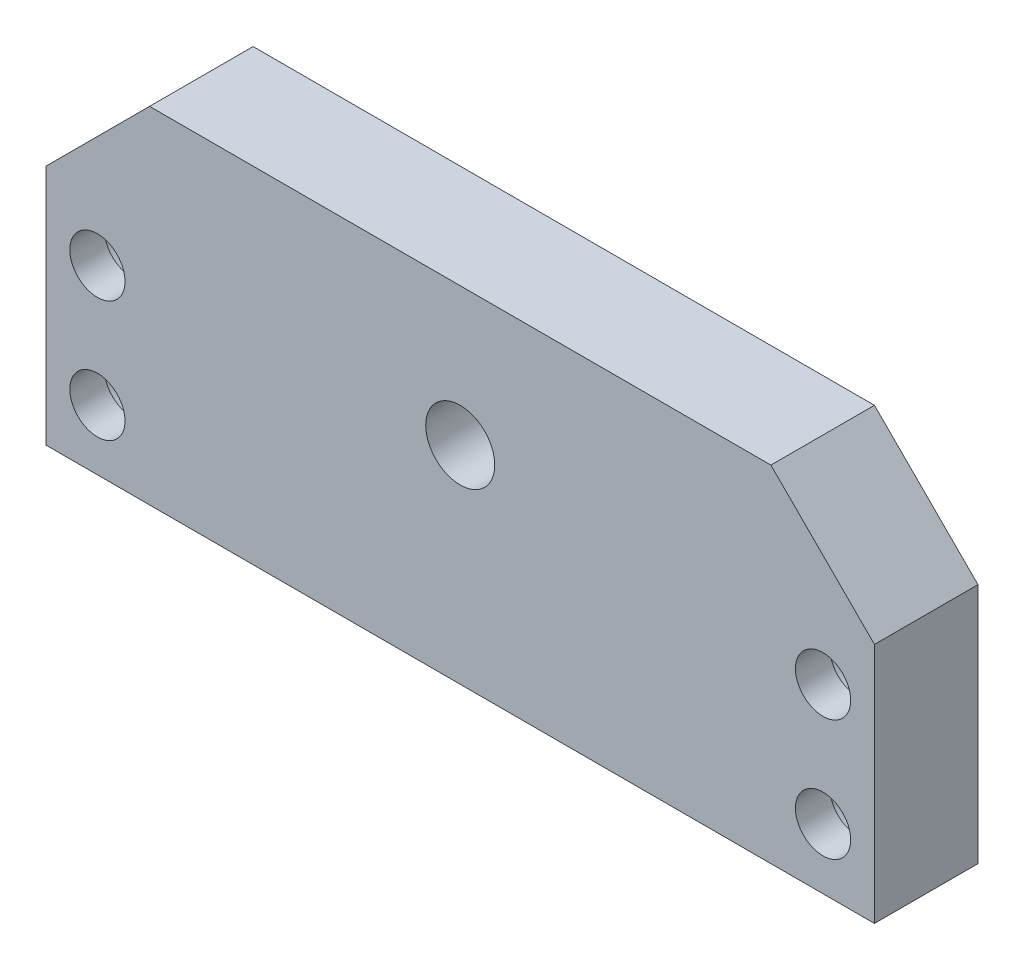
ISO-10303-21;
HEADER;
FILE_DESCRIPTION(('STEP AP214'),'2;1');
FILE_NAME('part.step','',(''),(''),'','','');
FILE_SCHEMA(('AUTOMOTIVE_DESIGN { 1 0 10303 214 1 1 1 1 }'));
ENDSEC;
DATA;
#1=APPLICATION_CONTEXT('core data for automotive mechanical design processes');
#2=APPLICATION_PROTOCOL_DEFINITION('international standard','automotive_design',2000,#1);
#3=PRODUCT_CONTEXT('',#1,'mechanical');
#4=PRODUCT('Part','Part','',(#3));
#5=PRODUCT_RELATED_PRODUCT_CATEGORY('part','',(#4));
#6=PRODUCT_DEFINITION_FORMATION('','',#4);
#7=PRODUCT_DEFINITION_CONTEXT('part definition',#1,'design');
#8=PRODUCT_DEFINITION('design','',#6,#7);
#9=PRODUCT_DEFINITION_SHAPE('','',#8);
#10=(LENGTH_UNIT() NAMED_UNIT(*) SI_UNIT(.MILLI.,.METRE.));
#11=(NAMED_UNIT(*) PLANE_ANGLE_UNIT() SI_UNIT($,.RADIAN.));
#12=(NAMED_UNIT(*) SI_UNIT($,.STERADIAN.) SOLID_ANGLE_UNIT());
#13=UNCERTAINTY_MEASURE_WITH_UNIT(LENGTH_MEASURE(1.E-05),#10,'distance_accuracy_value','');
#14=(GEOMETRIC_REPRESENTATION_CONTEXT(3) GLOBAL_UNCERTAINTY_ASSIGNED_CONTEXT((#13)) GLOBAL_UNIT_ASSIGNED_CONTEXT((#10,
#11,#12)) REPRESENTATION_CONTEXT('',''));
#15=CARTESIAN_POINT('',(0.,0.,0.));
#16=DIRECTION('',(0.,0.,1.));
#17=DIRECTION('',(1.,0.,0.));
#18=AXIS2_PLACEMENT_3D('',#15,#16,#17);
#19=CARTESIAN_POINT('',(0.,0.,0.));
#20=DIRECTION('',(0.,0.,-1.));
#21=DIRECTION('',(-1.,0.,0.));
#22=AXIS2_PLACEMENT_3D('',#19,#20,#21);
#23=PLANE('',#22);
#24=CARTESIAN_POINT('',(0.,4.99999999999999,0.));
#25=DIRECTION('',(0.,0.,-1.));
#26=DIRECTION('',(-1.,0.,0.));
#27=AXIS2_PLACEMENT_3D('',#24,#25,#26);
#28=CIRCLE('',#27,5.);
#29=CARTESIAN_POINT('',(-5.,4.99999999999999,0.));
#30=VERTEX_POINT('',#29);
#31=EDGE_CURVE('E194',#30,#30,#28,.T.);
#32=ORIENTED_EDGE('',*,*,#31,.F.);
#33=EDGE_LOOP('',(#32));
#34=FACE_BOUND('',#33,.T.);
#35=CARTESIAN_POINT('',(-52.5535278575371,1.25000000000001,0.));
#36=DIRECTION('',(0.,0.,-1.));
#37=DIRECTION('',(-1.,0.,0.));
#38=AXIS2_PLACEMENT_3D('',#35,#36,#37);
#39=CIRCLE('',#38,6.25);
#40=CARTESIAN_POINT('',(-58.8035278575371,1.25000000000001,0.));
#41=VERTEX_POINT('',#40);
#42=EDGE_CURVE('E160',#41,#41,#39,.F.);
#43=ORIENTED_EDGE('',*,*,#42,.T.);
#44=EDGE_LOOP('',(#43));
#45=FACE_BOUND('',#44,.T.);
#46=CARTESIAN_POINT('',(-52.5535278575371,-16.25,0.));
#47=DIRECTION('',(0.,0.,-1.));
#48=DIRECTION('',(-1.,0.,0.));
#49=AXIS2_PLACEMENT_3D('',#46,#47,#48);
#50=CIRCLE('',#49,6.25);
#51=CARTESIAN_POINT('',(-58.8035278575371,-16.25,0.));
#52=VERTEX_POINT('',#51);
#53=EDGE_CURVE('E153',#52,#52,#50,.F.);
#54=ORIENTED_EDGE('',*,*,#53,.T.);
#55=EDGE_LOOP('',(#54));
#56=FACE_BOUND('',#55,.T.);
#57=CARTESIAN_POINT('',(52.5535278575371,1.25,0.));
#58=DIRECTION('',(0.,0.,-1.));
#59=DIRECTION('',(-1.,0.,0.));
#60=AXIS2_PLACEMENT_3D('',#57,#58,#59);
#61=CIRCLE('',#60,6.25);
#62=CARTESIAN_POINT('',(46.3035278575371,1.25,0.));
#63=VERTEX_POINT('',#62);
#64=EDGE_CURVE('E147',#63,#63,#61,.T.);
#65=ORIENTED_EDGE('',*,*,#64,.F.);
#66=EDGE_LOOP('',(#65));
#67=FACE_BOUND('',#66,.T.);
#68=DIRECTION('',(0.,-1.,0.));
#69=VECTOR('',#68,1.);
#70=CARTESIAN_POINT('',(-60.,-25.,0.));
#71=LINE('',#70,#69);
#72=CARTESIAN_POINT('',(-60.,10.,0.));
#73=VERTEX_POINT('',#72);
#74=CARTESIAN_POINT('',(-60.,-25.,0.));
#75=VERTEX_POINT('',#74);
#76=EDGE_CURVE('E104',#73,#75,#71,.T.);
#77=ORIENTED_EDGE('',*,*,#76,.F.);
#78=DIRECTION('',(-0.707106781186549,-0.707106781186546,0.));
#79=VECTOR('',#78,1.);
#80=CARTESIAN_POINT('',(-34.9999999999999,35.,0.));
#81=LINE('',#80,#79);
#82=CARTESIAN_POINT('',(-44.9999999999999,25.,0.));
#83=VERTEX_POINT('',#82);
#84=EDGE_CURVE('E128',#73,#83,#81,.F.);
#85=ORIENTED_EDGE('',*,*,#84,.T.);
#86=DIRECTION('',(-1.,0.,0.));
#87=VECTOR('',#86,1.);
#88=CARTESIAN_POINT('',(-60.,25.,0.));
#89=LINE('',#88,#87);
#90=CARTESIAN_POINT('',(45.,25.,0.));
#91=VERTEX_POINT('',#90);
#92=EDGE_CURVE('E118',#91,#83,#89,.T.);
#93=ORIENTED_EDGE('',*,*,#92,.F.);
#94=DIRECTION('',(-0.707106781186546,0.707106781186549,0.));
#95=VECTOR('',#94,1.);
#96=CARTESIAN_POINT('',(35.0000000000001,35.,0.));
#97=LINE('',#96,#95);
#98=CARTESIAN_POINT('',(60.,9.99999999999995,0.));
#99=VERTEX_POINT('',#98);
#100=EDGE_CURVE('E126',#91,#99,#97,.F.);
#101=ORIENTED_EDGE('',*,*,#100,.T.);
#102=DIRECTION('',(0.,1.,0.));
#103=VECTOR('',#102,1.);
#104=CARTESIAN_POINT('',(60.,-25.,0.));
#105=LINE('',#104,#103);
#106=CARTESIAN_POINT('',(60.,-25.,0.));
#107=VERTEX_POINT('',#106);
#108=EDGE_CURVE('E116',#107,#99,#105,.T.);
#109=ORIENTED_EDGE('',*,*,#108,.F.);
#110=DIRECTION('',(1.,0.,0.));
#111=VECTOR('',#110,1.);
#112=CARTESIAN_POINT('',(-60.,-25.,0.));
#113=LINE('',#112,#111);
#114=EDGE_CURVE('E122',#75,#107,#113,.T.);
#115=ORIENTED_EDGE('',*,*,#114,.F.);
#116=EDGE_LOOP('',(#77,#85,#93,#101,#109,#115));
#117=FACE_BOUND('',#116,.T.);
#118=CARTESIAN_POINT('',(52.5535278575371,-16.25,0.));
#119=DIRECTION('',(0.,0.,-1.));
#120=DIRECTION('',(-1.,0.,0.));
#121=AXIS2_PLACEMENT_3D('',#118,#119,#120);
#122=CIRCLE('',#121,6.25);
#123=CARTESIAN_POINT('',(46.3035278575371,-16.25,0.));
#124=VERTEX_POINT('',#123);
#125=EDGE_CURVE('E166',#124,#124,#122,.T.);
#126=ORIENTED_EDGE('',*,*,#125,.F.);
#127=EDGE_LOOP('',(#126));
#128=FACE_BOUND('',#127,.T.);
#129=ADVANCED_FACE('F33',(#34,#45,#56,#67,#117,#128),#23,.T.);
#130=CARTESIAN_POINT('',(60.,-25.,15.));
#131=DIRECTION('',(-1.,0.,0.));
#132=DIRECTION('',(0.,0.,1.));
#133=AXIS2_PLACEMENT_3D('',#130,#131,#132);
#134=PLANE('',#133);
#135=ORIENTED_EDGE('',*,*,#108,.T.);
#136=DIRECTION('',(0.,0.,1.));
#137=VECTOR('',#136,1.);
#138=CARTESIAN_POINT('',(60.,9.99999999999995,15.));
#139=LINE('',#138,#137);
#140=CARTESIAN_POINT('',(60.,9.99999999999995,15.));
#141=VERTEX_POINT('',#140);
#142=EDGE_CURVE('E11',#99,#141,#139,.T.);
#143=ORIENTED_EDGE('',*,*,#142,.T.);
#144=DIRECTION('',(0.,1.,0.));
#145=VECTOR('',#144,1.);
#146=CARTESIAN_POINT('',(60.,-25.,15.));
#147=LINE('',#146,#145);
#148=CARTESIAN_POINT('',(60.,-25.,15.));
#149=VERTEX_POINT('',#148);
#150=EDGE_CURVE('E123',#149,#141,#147,.T.);
#151=ORIENTED_EDGE('',*,*,#150,.F.);
#152=DIRECTION('',(0.,0.,-1.));
#153=VECTOR('',#152,1.);
#154=CARTESIAN_POINT('',(60.,-25.,15.));
#155=LINE('',#154,#153);
#156=EDGE_CURVE('E108',#149,#107,#155,.T.);
#157=ORIENTED_EDGE('',*,*,#156,.T.);
#158=EDGE_LOOP('',(#135,#143,#151,#157));
#159=FACE_BOUND('',#158,.T.);
#160=ADVANCED_FACE('F144',(#159),#134,.F.);
#161=CARTESIAN_POINT('',(-60.,25.,15.));
#162=DIRECTION('',(0.,-1.,0.));
#163=DIRECTION('',(0.,0.,-1.));
#164=AXIS2_PLACEMENT_3D('',#161,#162,#163);
#165=PLANE('',#164);
#166=ORIENTED_EDGE('',*,*,#92,.T.);
#167=DIRECTION('',(0.,0.,1.));
#168=VECTOR('',#167,1.);
#169=CARTESIAN_POINT('',(-44.9999999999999,25.,15.));
#170=LINE('',#169,#168);
#171=CARTESIAN_POINT('',(-44.9999999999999,25.,15.));
#172=VERTEX_POINT('',#171);
#173=EDGE_CURVE('E55',#83,#172,#170,.T.);
#174=ORIENTED_EDGE('',*,*,#173,.T.);
#175=DIRECTION('',(-1.,0.,0.));
#176=VECTOR('',#175,1.);
#177=CARTESIAN_POINT('',(-60.,25.,15.));
#178=LINE('',#177,#176);
#179=CARTESIAN_POINT('',(45.,25.,15.));
#180=VERTEX_POINT('',#179);
#181=EDGE_CURVE('E98',#180,#172,#178,.T.);
#182=ORIENTED_EDGE('',*,*,#181,.F.);
#183=DIRECTION('',(0.,0.,-1.));
#184=VECTOR('',#183,1.);
#185=CARTESIAN_POINT('',(45.,25.,15.));
#186=LINE('',#185,#184);
#187=EDGE_CURVE('E130',#180,#91,#186,.T.);
#188=ORIENTED_EDGE('',*,*,#187,.T.);
#189=EDGE_LOOP('',(#166,#174,#182,#188));
#190=FACE_BOUND('',#189,.T.);
#191=ADVANCED_FACE('F139',(#190),#165,.F.);
#192=CARTESIAN_POINT('',(-60.,-25.,15.));
#193=DIRECTION('',(1.,0.,0.));
#194=DIRECTION('',(0.,0.,-1.));
#195=AXIS2_PLACEMENT_3D('',#192,#193,#194);
#196=PLANE('',#195);
#197=DIRECTION('',(0.,-1.,0.));
#198=VECTOR('',#197,1.);
#199=CARTESIAN_POINT('',(-60.,-25.,15.));
#200=LINE('',#199,#198);
#201=CARTESIAN_POINT('',(-60.,10.,15.));
#202=VERTEX_POINT('',#201);
#203=CARTESIAN_POINT('',(-60.,-25.,15.));
#204=VERTEX_POINT('',#203);
#205=EDGE_CURVE('E88',#202,#204,#200,.T.);
#206=ORIENTED_EDGE('',*,*,#205,.F.);
#207=DIRECTION('',(0.,0.,-1.));
#208=VECTOR('',#207,1.);
#209=CARTESIAN_POINT('',(-60.,10.,15.));
#210=LINE('',#209,#208);
#211=EDGE_CURVE('E107',#202,#73,#210,.T.);
#212=ORIENTED_EDGE('',*,*,#211,.T.);
#213=ORIENTED_EDGE('',*,*,#76,.T.);
#214=DIRECTION('',(0.,0.,-1.));
#215=VECTOR('',#214,1.);
#216=CARTESIAN_POINT('',(-60.,-25.,15.));
#217=LINE('',#216,#215);
#218=EDGE_CURVE('E101',#204,#75,#217,.T.);
#219=ORIENTED_EDGE('',*,*,#218,.F.);
#220=EDGE_LOOP('',(#206,#212,#213,#219));
#221=FACE_BOUND('',#220,.T.);
#222=ADVANCED_FACE('F102',(#221),#196,.F.);
#223=CARTESIAN_POINT('',(-60.,-25.,15.));
#224=DIRECTION('',(0.,1.,0.));
#225=DIRECTION('',(0.,0.,1.));
#226=AXIS2_PLACEMENT_3D('',#223,#224,#225);
#227=PLANE('',#226);
#228=ORIENTED_EDGE('',*,*,#114,.T.);
#229=ORIENTED_EDGE('',*,*,#156,.F.);
#230=DIRECTION('',(1.,0.,0.));
#231=VECTOR('',#230,1.);
#232=CARTESIAN_POINT('',(-60.,-25.,15.));
#233=LINE('',#232,#231);
#234=EDGE_CURVE('E92',#204,#149,#233,.T.);
#235=ORIENTED_EDGE('',*,*,#234,.F.);
#236=ORIENTED_EDGE('',*,*,#218,.T.);
#237=EDGE_LOOP('',(#228,#229,#235,#236));
#238=FACE_BOUND('',#237,.T.);
#239=ADVANCED_FACE('F110',(#238),#227,.F.);
#240=CARTESIAN_POINT('',(0.,0.,15.));
#241=DIRECTION('',(0.,0.,-1.));
#242=DIRECTION('',(-1.,0.,0.));
#243=AXIS2_PLACEMENT_3D('',#240,#241,#242);
#244=PLANE('',#243);
#245=CARTESIAN_POINT('',(0.,4.99999999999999,15.));
#246=DIRECTION('',(0.,0.,-1.));
#247=DIRECTION('',(-1.,0.,0.));
#248=AXIS2_PLACEMENT_3D('',#245,#246,#247);
#249=CIRCLE('',#248,5.);
#250=CARTESIAN_POINT('',(-5.,4.99999999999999,15.));
#251=VERTEX_POINT('',#250);
#252=EDGE_CURVE('E37',#251,#251,#249,.T.);
#253=ORIENTED_EDGE('',*,*,#252,.T.);
#254=EDGE_LOOP('',(#253));
#255=FACE_BOUND('',#254,.T.);
#256=CARTESIAN_POINT('',(52.5535278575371,-16.25,15.));
#257=DIRECTION('',(0.,0.,-1.));
#258=DIRECTION('',(-1.,0.,0.));
#259=AXIS2_PLACEMENT_3D('',#256,#257,#258);
#260=CIRCLE('',#259,4.00000000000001);
#261=CARTESIAN_POINT('',(48.5535278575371,-16.25,15.));
#262=VERTEX_POINT('',#261);
#263=EDGE_CURVE('E182',#262,#262,#260,.T.);
#264=ORIENTED_EDGE('',*,*,#263,.T.);
#265=EDGE_LOOP('',(#264));
#266=FACE_BOUND('',#265,.T.);
#267=CARTESIAN_POINT('',(-52.5535278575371,-16.25,15.));
#268=DIRECTION('',(0.,0.,-1.));
#269=DIRECTION('',(-1.,0.,0.));
#270=AXIS2_PLACEMENT_3D('',#267,#268,#269);
#271=CIRCLE('',#270,4.00000000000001);
#272=CARTESIAN_POINT('',(-56.5535278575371,-16.25,15.));
#273=VERTEX_POINT('',#272);
#274=EDGE_CURVE('E176',#273,#273,#271,.T.);
#275=ORIENTED_EDGE('',*,*,#274,.T.);
#276=EDGE_LOOP('',(#275));
#277=FACE_BOUND('',#276,.T.);
#278=CARTESIAN_POINT('',(-52.5535278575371,1.25000000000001,15.));
#279=DIRECTION('',(0.,0.,-1.));
#280=DIRECTION('',(-1.,0.,0.));
#281=AXIS2_PLACEMENT_3D('',#278,#279,#280);
#282=CIRCLE('',#281,4.00000000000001);
#283=CARTESIAN_POINT('',(-56.5535278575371,1.25000000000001,15.));
#284=VERTEX_POINT('',#283);
#285=EDGE_CURVE('E179',#284,#284,#282,.T.);
#286=ORIENTED_EDGE('',*,*,#285,.T.);
#287=EDGE_LOOP('',(#286));
#288=FACE_BOUND('',#287,.T.);
#289=CARTESIAN_POINT('',(52.5535278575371,1.25,15.));
#290=DIRECTION('',(0.,0.,-1.));
#291=DIRECTION('',(-1.,0.,0.));
#292=AXIS2_PLACEMENT_3D('',#289,#290,#291);
#293=CIRCLE('',#292,4.00000000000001);
#294=CARTESIAN_POINT('',(48.5535278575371,1.25,15.));
#295=VERTEX_POINT('',#294);
#296=EDGE_CURVE('E157',#295,#295,#293,.T.);
#297=ORIENTED_EDGE('',*,*,#296,.T.);
#298=EDGE_LOOP('',(#297));
#299=FACE_BOUND('',#298,.T.);
#300=ORIENTED_EDGE('',*,*,#181,.T.);
#301=DIRECTION('',(0.707106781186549,0.707106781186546,0.));
#302=VECTOR('',#301,1.);
#303=CARTESIAN_POINT('',(-60.,10.,15.));
#304=LINE('',#303,#302);
#305=EDGE_CURVE('E42',#172,#202,#304,.F.);
#306=ORIENTED_EDGE('',*,*,#305,.T.);
#307=ORIENTED_EDGE('',*,*,#205,.T.);
#308=ORIENTED_EDGE('',*,*,#234,.T.);
#309=ORIENTED_EDGE('',*,*,#150,.T.);
#310=DIRECTION('',(0.707106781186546,-0.707106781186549,0.));
#311=VECTOR('',#310,1.);
#312=CARTESIAN_POINT('',(45.,25.,15.));
#313=LINE('',#312,#311);
#314=EDGE_CURVE('E134',#141,#180,#313,.F.);
#315=ORIENTED_EDGE('',*,*,#314,.T.);
#316=EDGE_LOOP('',(#300,#306,#307,#308,#309,#315));
#317=FACE_BOUND('',#316,.T.);
#318=ADVANCED_FACE('F90',(#255,#266,#277,#288,#299,#317),#244,.F.);
#319=CARTESIAN_POINT('',(-60.,10.,15.));
#320=DIRECTION('',(0.707106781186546,-0.707106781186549,0.));
#321=DIRECTION('',(0.,0.,-1.));
#322=AXIS2_PLACEMENT_3D('',#319,#320,#321);
#323=PLANE('',#322);
#324=ORIENTED_EDGE('',*,*,#305,.F.);
#325=ORIENTED_EDGE('',*,*,#173,.F.);
#326=ORIENTED_EDGE('',*,*,#84,.F.);
#327=ORIENTED_EDGE('',*,*,#211,.F.);
#328=EDGE_LOOP('',(#324,#325,#326,#327));
#329=FACE_BOUND('',#328,.T.);
#330=ADVANCED_FACE('F232',(#329),#323,.F.);
#331=CARTESIAN_POINT('',(45.,25.,15.));
#332=DIRECTION('',(-0.707106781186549,-0.707106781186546,0.));
#333=DIRECTION('',(0.,0.,-1.));
#334=AXIS2_PLACEMENT_3D('',#331,#332,#333);
#335=PLANE('',#334);
#336=ORIENTED_EDGE('',*,*,#314,.F.);
#337=ORIENTED_EDGE('',*,*,#142,.F.);
#338=ORIENTED_EDGE('',*,*,#100,.F.);
#339=ORIENTED_EDGE('',*,*,#187,.F.);
#340=EDGE_LOOP('',(#336,#337,#338,#339));
#341=FACE_BOUND('',#340,.T.);
#342=ADVANCED_FACE('F35',(#341),#335,.F.);
#343=CARTESIAN_POINT('',(52.5535278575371,1.25,10.));
#344=DIRECTION('',(0.,0.,-1.));
#345=DIRECTION('',(-1.,0.,0.));
#346=AXIS2_PLACEMENT_3D('',#343,#344,#345);
#347=CYLINDRICAL_SURFACE('',#346,6.25);
#348=CARTESIAN_POINT('',(52.5535278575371,1.25,10.));
#349=DIRECTION('',(0.,0.,-1.));
#350=DIRECTION('',(-1.,0.,0.));
#351=AXIS2_PLACEMENT_3D('',#348,#349,#350);
#352=CIRCLE('',#351,6.25);
#353=CARTESIAN_POINT('',(46.3035278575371,1.25,10.));
#354=VERTEX_POINT('',#353);
#355=EDGE_CURVE('E119',#354,#354,#352,.T.);
#356=ORIENTED_EDGE('',*,*,#355,.F.);
#357=EDGE_LOOP('',(#356));
#358=FACE_BOUND('',#357,.T.);
#359=ORIENTED_EDGE('',*,*,#64,.T.);
#360=EDGE_LOOP('',(#359));
#361=FACE_BOUND('',#360,.T.);
#362=ADVANCED_FACE('F239',(#358,#361),#347,.F.);
#363=CARTESIAN_POINT('',(0.,0.,10.));
#364=DIRECTION('',(0.,0.,-1.));
#365=DIRECTION('',(-1.,0.,0.));
#366=AXIS2_PLACEMENT_3D('',#363,#364,#365);
#367=PLANE('',#366);
#368=CARTESIAN_POINT('',(52.5535278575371,1.25,10.));
#369=DIRECTION('',(0.,0.,-1.));
#370=DIRECTION('',(-1.,0.,0.));
#371=AXIS2_PLACEMENT_3D('',#368,#369,#370);
#372=CIRCLE('',#371,4.00000000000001);
#373=CARTESIAN_POINT('',(48.5535278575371,1.25,10.));
#374=VERTEX_POINT('',#373);
#375=EDGE_CURVE('E173',#374,#374,#372,.T.);
#376=ORIENTED_EDGE('',*,*,#375,.F.);
#377=EDGE_LOOP('',(#376));
#378=FACE_BOUND('',#377,.T.);
#379=ORIENTED_EDGE('',*,*,#355,.T.);
#380=EDGE_LOOP('',(#379));
#381=FACE_BOUND('',#380,.T.);
#382=ADVANCED_FACE('F329',(#378,#381),#367,.T.);
#383=CARTESIAN_POINT('',(-52.5535278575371,-16.25,10.));
#384=DIRECTION('',(0.,0.,-1.));
#385=DIRECTION('',(-1.,0.,0.));
#386=AXIS2_PLACEMENT_3D('',#383,#384,#385);
#387=CYLINDRICAL_SURFACE('',#386,6.25);
#388=CARTESIAN_POINT('',(-52.5535278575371,-16.25,10.));
#389=DIRECTION('',(0.,0.,-1.));
#390=DIRECTION('',(-1.,0.,0.));
#391=AXIS2_PLACEMENT_3D('',#388,#389,#390);
#392=CIRCLE('',#391,6.25);
#393=CARTESIAN_POINT('',(-58.8035278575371,-16.25,10.));
#394=VERTEX_POINT('',#393);
#395=EDGE_CURVE('E156',#394,#394,#392,.F.);
#396=ORIENTED_EDGE('',*,*,#395,.T.);
#397=EDGE_LOOP('',(#396));
#398=FACE_BOUND('',#397,.T.);
#399=ORIENTED_EDGE('',*,*,#53,.F.);
#400=EDGE_LOOP('',(#399));
#401=FACE_BOUND('',#400,.T.);
#402=ADVANCED_FACE('F321',(#398,#401),#387,.F.);
#403=CARTESIAN_POINT('',(0.,0.,10.));
#404=DIRECTION('',(0.,0.,-1.));
#405=DIRECTION('',(-1.,0.,0.));
#406=AXIS2_PLACEMENT_3D('',#403,#404,#405);
#407=PLANE('',#406);
#408=CARTESIAN_POINT('',(-52.5535278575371,-16.25,10.));
#409=DIRECTION('',(0.,0.,-1.));
#410=DIRECTION('',(-1.,0.,0.));
#411=AXIS2_PLACEMENT_3D('',#408,#409,#410);
#412=CIRCLE('',#411,4.00000000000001);
#413=CARTESIAN_POINT('',(-56.5535278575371,-16.25,10.));
#414=VERTEX_POINT('',#413);
#415=EDGE_CURVE('E189',#414,#414,#412,.T.);
#416=ORIENTED_EDGE('',*,*,#415,.F.);
#417=EDGE_LOOP('',(#416));
#418=FACE_BOUND('',#417,.T.);
#419=ORIENTED_EDGE('',*,*,#395,.F.);
#420=EDGE_LOOP('',(#419));
#421=FACE_BOUND('',#420,.T.);
#422=ADVANCED_FACE('F312',(#418,#421),#407,.T.);
#423=CARTESIAN_POINT('',(-52.5535278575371,1.25000000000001,10.));
#424=DIRECTION('',(0.,0.,-1.));
#425=DIRECTION('',(-1.,0.,0.));
#426=AXIS2_PLACEMENT_3D('',#423,#424,#425);
#427=CYLINDRICAL_SURFACE('',#426,6.25);
#428=CARTESIAN_POINT('',(-52.5535278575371,1.25000000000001,10.));
#429=DIRECTION('',(0.,0.,-1.));
#430=DIRECTION('',(-1.,0.,0.));
#431=AXIS2_PLACEMENT_3D('',#428,#429,#430);
#432=CIRCLE('',#431,6.25);
#433=CARTESIAN_POINT('',(-58.8035278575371,1.25000000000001,10.));
#434=VERTEX_POINT('',#433);
#435=EDGE_CURVE('E163',#434,#434,#432,.F.);
#436=ORIENTED_EDGE('',*,*,#435,.T.);
#437=EDGE_LOOP('',(#436));
#438=FACE_BOUND('',#437,.T.);
#439=ORIENTED_EDGE('',*,*,#42,.F.);
#440=EDGE_LOOP('',(#439));
#441=FACE_BOUND('',#440,.T.);
#442=ADVANCED_FACE('F303',(#438,#441),#427,.F.);
#443=CARTESIAN_POINT('',(0.,0.,10.));
#444=DIRECTION('',(0.,0.,-1.));
#445=DIRECTION('',(-1.,0.,0.));
#446=AXIS2_PLACEMENT_3D('',#443,#444,#445);
#447=PLANE('',#446);
#448=CARTESIAN_POINT('',(-52.5535278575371,1.25000000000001,10.));
#449=DIRECTION('',(0.,0.,-1.));
#450=DIRECTION('',(-1.,0.,0.));
#451=AXIS2_PLACEMENT_3D('',#448,#449,#450);
#452=CIRCLE('',#451,4.00000000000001);
#453=CARTESIAN_POINT('',(-56.5535278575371,1.25000000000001,10.));
#454=VERTEX_POINT('',#453);
#455=EDGE_CURVE('E186',#454,#454,#452,.T.);
#456=ORIENTED_EDGE('',*,*,#455,.F.);
#457=EDGE_LOOP('',(#456));
#458=FACE_BOUND('',#457,.T.);
#459=ORIENTED_EDGE('',*,*,#435,.F.);
#460=EDGE_LOOP('',(#459));
#461=FACE_BOUND('',#460,.T.);
#462=ADVANCED_FACE('F293',(#458,#461),#447,.T.);
#463=CARTESIAN_POINT('',(52.5535278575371,-16.25,10.));
#464=DIRECTION('',(0.,0.,-1.));
#465=DIRECTION('',(-1.,0.,0.));
#466=AXIS2_PLACEMENT_3D('',#463,#464,#465);
#467=CYLINDRICAL_SURFACE('',#466,6.25);
#468=CARTESIAN_POINT('',(52.5535278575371,-16.25,10.));
#469=DIRECTION('',(0.,0.,-1.));
#470=DIRECTION('',(-1.,0.,0.));
#471=AXIS2_PLACEMENT_3D('',#468,#469,#470);
#472=CIRCLE('',#471,6.25);
#473=CARTESIAN_POINT('',(46.3035278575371,-16.25,10.));
#474=VERTEX_POINT('',#473);
#475=EDGE_CURVE('E150',#474,#474,#472,.T.);
#476=ORIENTED_EDGE('',*,*,#475,.F.);
#477=EDGE_LOOP('',(#476));
#478=FACE_BOUND('',#477,.T.);
#479=ORIENTED_EDGE('',*,*,#125,.T.);
#480=EDGE_LOOP('',(#479));
#481=FACE_BOUND('',#480,.T.);
#482=ADVANCED_FACE('F283',(#478,#481),#467,.F.);
#483=CARTESIAN_POINT('',(0.,0.,10.));
#484=DIRECTION('',(0.,0.,-1.));
#485=DIRECTION('',(-1.,0.,0.));
#486=AXIS2_PLACEMENT_3D('',#483,#484,#485);
#487=PLANE('',#486);
#488=CARTESIAN_POINT('',(52.5535278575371,-16.25,10.));
#489=DIRECTION('',(0.,0.,-1.));
#490=DIRECTION('',(-1.,0.,0.));
#491=AXIS2_PLACEMENT_3D('',#488,#489,#490);
#492=CIRCLE('',#491,4.00000000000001);
#493=CARTESIAN_POINT('',(48.5535278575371,-16.25,10.));
#494=VERTEX_POINT('',#493);
#495=EDGE_CURVE('E185',#494,#494,#492,.T.);
#496=ORIENTED_EDGE('',*,*,#495,.F.);
#497=EDGE_LOOP('',(#496));
#498=FACE_BOUND('',#497,.T.);
#499=ORIENTED_EDGE('',*,*,#475,.T.);
#500=EDGE_LOOP('',(#499));
#501=FACE_BOUND('',#500,.T.);
#502=ADVANCED_FACE('F274',(#498,#501),#487,.T.);
#503=CARTESIAN_POINT('',(52.5535278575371,1.25,20.));
#504=DIRECTION('',(0.,0.,-1.));
#505=DIRECTION('',(-1.,0.,0.));
#506=AXIS2_PLACEMENT_3D('',#503,#504,#505);
#507=CYLINDRICAL_SURFACE('',#506,4.00000000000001);
#508=ORIENTED_EDGE('',*,*,#375,.T.);
#509=EDGE_LOOP('',(#508));
#510=FACE_BOUND('',#509,.T.);
#511=ORIENTED_EDGE('',*,*,#296,.F.);
#512=EDGE_LOOP('',(#511));
#513=FACE_BOUND('',#512,.T.);
#514=ADVANCED_FACE('F266',(#510,#513),#507,.F.);
#515=CARTESIAN_POINT('',(52.5535278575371,-16.25,20.));
#516=DIRECTION('',(0.,0.,-1.));
#517=DIRECTION('',(-1.,0.,0.));
#518=AXIS2_PLACEMENT_3D('',#515,#516,#517);
#519=CYLINDRICAL_SURFACE('',#518,4.00000000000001);
#520=ORIENTED_EDGE('',*,*,#495,.T.);
#521=EDGE_LOOP('',(#520));
#522=FACE_BOUND('',#521,.T.);
#523=ORIENTED_EDGE('',*,*,#263,.F.);
#524=EDGE_LOOP('',(#523));
#525=FACE_BOUND('',#524,.T.);
#526=ADVANCED_FACE('F257',(#522,#525),#519,.F.);
#527=CARTESIAN_POINT('',(-52.5535278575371,1.25000000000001,20.));
#528=DIRECTION('',(0.,0.,-1.));
#529=DIRECTION('',(-1.,0.,0.));
#530=AXIS2_PLACEMENT_3D('',#527,#528,#529);
#531=CYLINDRICAL_SURFACE('',#530,4.00000000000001);
#532=ORIENTED_EDGE('',*,*,#455,.T.);
#533=EDGE_LOOP('',(#532));
#534=FACE_BOUND('',#533,.T.);
#535=ORIENTED_EDGE('',*,*,#285,.F.);
#536=EDGE_LOOP('',(#535));
#537=FACE_BOUND('',#536,.T.);
#538=ADVANCED_FACE('F210',(#534,#537),#531,.F.);
#539=CARTESIAN_POINT('',(-52.5535278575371,-16.25,20.));
#540=DIRECTION('',(0.,0.,-1.));
#541=DIRECTION('',(-1.,0.,0.));
#542=AXIS2_PLACEMENT_3D('',#539,#540,#541);
#543=CYLINDRICAL_SURFACE('',#542,4.00000000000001);
#544=ORIENTED_EDGE('',*,*,#415,.T.);
#545=EDGE_LOOP('',(#544));
#546=FACE_BOUND('',#545,.T.);
#547=ORIENTED_EDGE('',*,*,#274,.F.);
#548=EDGE_LOOP('',(#547));
#549=FACE_BOUND('',#548,.T.);
#550=ADVANCED_FACE('F205',(#546,#549),#543,.F.);
#551=CARTESIAN_POINT('',(0.,4.99999999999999,50.));
#552=DIRECTION('',(0.,0.,-1.));
#553=DIRECTION('',(-1.,0.,0.));
#554=AXIS2_PLACEMENT_3D('',#551,#552,#553);
#555=CYLINDRICAL_SURFACE('',#554,5.);
#556=ORIENTED_EDGE('',*,*,#31,.T.);
#557=EDGE_LOOP('',(#556));
#558=FACE_BOUND('',#557,.T.);
#559=ORIENTED_EDGE('',*,*,#252,.F.);
#560=EDGE_LOOP('',(#559));
#561=FACE_BOUND('',#560,.T.);
#562=ADVANCED_FACE('F203',(#558,#561),#555,.F.);
#563=CLOSED_SHELL('',(#129,#160,#191,#222,#239,#318,#330,#342,#362,#382,#402,#422,#442,#462,
#482,#502,#514,#526,#538,#550,#562));
#564=MANIFOLD_SOLID_BREP('B2',#563);
#565=ADVANCED_BREP_SHAPE_REPRESENTATION('',(#18,#564),#14);
#566=SHAPE_DEFINITION_REPRESENTATION(#9,#565);
ENDSEC;
END-ISO-10303-21;
